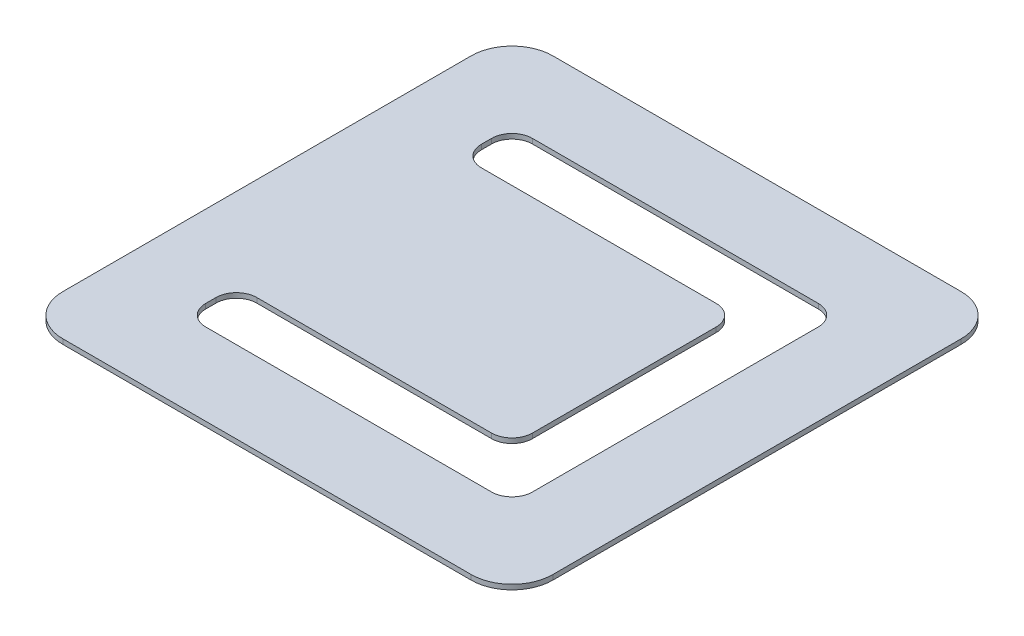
ISO-10303-21;
HEADER;
FILE_DESCRIPTION(('STEP AP214'),'2;1');
FILE_NAME('part.step','',(''),(''),'','','');
FILE_SCHEMA(('AUTOMOTIVE_DESIGN { 1 0 10303 214 1 1 1 1 }'));
ENDSEC;
DATA;
#1=APPLICATION_CONTEXT('core data for automotive mechanical design processes');
#2=APPLICATION_PROTOCOL_DEFINITION('international standard','automotive_design',2000,#1);
#3=PRODUCT_CONTEXT('',#1,'mechanical');
#4=PRODUCT('Part','Part','',(#3));
#5=PRODUCT_RELATED_PRODUCT_CATEGORY('part','',(#4));
#6=PRODUCT_DEFINITION_FORMATION('','',#4);
#7=PRODUCT_DEFINITION_CONTEXT('part definition',#1,'design');
#8=PRODUCT_DEFINITION('design','',#6,#7);
#9=PRODUCT_DEFINITION_SHAPE('','',#8);
#10=(LENGTH_UNIT() NAMED_UNIT(*) SI_UNIT(.MILLI.,.METRE.));
#11=(NAMED_UNIT(*) PLANE_ANGLE_UNIT() SI_UNIT($,.RADIAN.));
#12=(NAMED_UNIT(*) SI_UNIT($,.STERADIAN.) SOLID_ANGLE_UNIT());
#13=UNCERTAINTY_MEASURE_WITH_UNIT(LENGTH_MEASURE(1.E-05),#10,'distance_accuracy_value','');
#14=(GEOMETRIC_REPRESENTATION_CONTEXT(3) GLOBAL_UNCERTAINTY_ASSIGNED_CONTEXT((#13)) GLOBAL_UNIT_ASSIGNED_CONTEXT((#10,
#11,#12)) REPRESENTATION_CONTEXT('',''));
#15=CARTESIAN_POINT('',(0.,0.,0.));
#16=DIRECTION('',(0.,0.,1.));
#17=DIRECTION('',(1.,0.,0.));
#18=AXIS2_PLACEMENT_3D('',#15,#16,#17);
#19=CARTESIAN_POINT('',(63.5,1.524,-63.5));
#20=DIRECTION('',(0.,-1.,0.));
#21=DIRECTION('',(0.,0.,-1.));
#22=AXIS2_PLACEMENT_3D('',#19,#20,#21);
#23=PLANE('',#22);
#24=CARTESIAN_POINT('',(63.5,1.524,-63.5));
#25=DIRECTION('',(0.,1.,0.));
#26=DIRECTION('',(0.,0.,-1.));
#27=AXIS2_PLACEMENT_3D('',#24,#25,#26);
#28=CIRCLE('',#27,12.7);
#29=CARTESIAN_POINT('',(76.2,1.524,-63.5));
#30=VERTEX_POINT('',#29);
#31=CARTESIAN_POINT('',(63.5,1.524,-76.2));
#32=VERTEX_POINT('',#31);
#33=EDGE_CURVE('E317',#30,#32,#28,.T.);
#34=ORIENTED_EDGE('',*,*,#33,.T.);
#35=DIRECTION('',(-1.,0.,0.));
#36=VECTOR('',#35,1.);
#37=CARTESIAN_POINT('',(-63.5,1.524,-76.2));
#38=LINE('',#37,#36);
#39=CARTESIAN_POINT('',(-63.5,1.524,-76.2));
#40=VERTEX_POINT('',#39);
#41=EDGE_CURVE('E320',#32,#40,#38,.T.);
#42=ORIENTED_EDGE('',*,*,#41,.T.);
#43=CARTESIAN_POINT('',(-63.5,1.524,-63.5));
#44=DIRECTION('',(0.,1.,0.));
#45=DIRECTION('',(0.,0.,1.));
#46=AXIS2_PLACEMENT_3D('',#43,#44,#45);
#47=CIRCLE('',#46,12.7);
#48=CARTESIAN_POINT('',(-76.2,1.524,-63.5));
#49=VERTEX_POINT('',#48);
#50=EDGE_CURVE('E323',#40,#49,#47,.T.);
#51=ORIENTED_EDGE('',*,*,#50,.T.);
#52=DIRECTION('',(0.,0.,1.));
#53=VECTOR('',#52,1.);
#54=CARTESIAN_POINT('',(-76.2,1.524,-63.5));
#55=LINE('',#54,#53);
#56=CARTESIAN_POINT('',(-76.2,1.524,63.5));
#57=VERTEX_POINT('',#56);
#58=EDGE_CURVE('E325',#49,#57,#55,.T.);
#59=ORIENTED_EDGE('',*,*,#58,.T.);
#60=CARTESIAN_POINT('',(-63.5,1.524,63.5));
#61=DIRECTION('',(0.,1.,0.));
#62=DIRECTION('',(0.,0.,1.));
#63=AXIS2_PLACEMENT_3D('',#60,#61,#62);
#64=CIRCLE('',#63,12.7);
#65=CARTESIAN_POINT('',(-63.5,1.524,76.2));
#66=VERTEX_POINT('',#65);
#67=EDGE_CURVE('E327',#57,#66,#64,.T.);
#68=ORIENTED_EDGE('',*,*,#67,.T.);
#69=DIRECTION('',(1.,0.,0.));
#70=VECTOR('',#69,1.);
#71=CARTESIAN_POINT('',(-63.5,1.524,76.2));
#72=LINE('',#71,#70);
#73=CARTESIAN_POINT('',(63.5,1.524,76.2));
#74=VERTEX_POINT('',#73);
#75=EDGE_CURVE('E329',#66,#74,#72,.T.);
#76=ORIENTED_EDGE('',*,*,#75,.T.);
#77=CARTESIAN_POINT('',(63.5,1.524,63.5));
#78=DIRECTION('',(0.,1.,0.));
#79=DIRECTION('',(0.,0.,1.));
#80=AXIS2_PLACEMENT_3D('',#77,#78,#79);
#81=CIRCLE('',#80,12.7);
#82=CARTESIAN_POINT('',(76.2,1.524,63.5));
#83=VERTEX_POINT('',#82);
#84=EDGE_CURVE('E331',#74,#83,#81,.T.);
#85=ORIENTED_EDGE('',*,*,#84,.T.);
#86=DIRECTION('',(0.,0.,-1.));
#87=VECTOR('',#86,1.);
#88=CARTESIAN_POINT('',(76.2,1.524,-63.5));
#89=LINE('',#88,#87);
#90=EDGE_CURVE('E333',#83,#30,#89,.T.);
#91=ORIENTED_EDGE('',*,*,#90,.T.);
#92=EDGE_LOOP('',(#34,#42,#51,#59,#68,#76,#85,#91));
#93=FACE_BOUND('',#92,.T.);
#94=CARTESIAN_POINT('',(28.575,1.524,28.575));
#95=DIRECTION('',(0.,-1.,0.));
#96=DIRECTION('',(0.,0.,-1.));
#97=AXIS2_PLACEMENT_3D('',#94,#95,#96);
#98=CIRCLE('',#97,6.35);
#99=CARTESIAN_POINT('',(34.925,1.524,28.575));
#100=VERTEX_POINT('',#99);
#101=CARTESIAN_POINT('',(28.5749999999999,1.524,34.925));
#102=VERTEX_POINT('',#101);
#103=EDGE_CURVE('E196',#100,#102,#98,.T.);
#104=ORIENTED_EDGE('',*,*,#103,.F.);
#105=DIRECTION('',(0.,0.,1.));
#106=VECTOR('',#105,1.);
#107=CARTESIAN_POINT('',(34.925,1.524,-28.575));
#108=LINE('',#107,#106);
#109=CARTESIAN_POINT('',(34.925,1.524,-28.575));
#110=VERTEX_POINT('',#109);
#111=EDGE_CURVE('E245',#110,#100,#108,.T.);
#112=ORIENTED_EDGE('',*,*,#111,.F.);
#113=CARTESIAN_POINT('',(28.575,1.524,-28.5750000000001));
#114=DIRECTION('',(0.,-1.,0.));
#115=DIRECTION('',(0.,0.,-1.));
#116=AXIS2_PLACEMENT_3D('',#113,#114,#115);
#117=CIRCLE('',#116,6.35);
#118=CARTESIAN_POINT('',(28.5749999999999,1.524,-34.9250000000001));
#119=VERTEX_POINT('',#118);
#120=EDGE_CURVE('E243',#119,#110,#117,.T.);
#121=ORIENTED_EDGE('',*,*,#120,.F.);
#122=DIRECTION('',(1.,0.,0.));
#123=VECTOR('',#122,1.);
#124=CARTESIAN_POINT('',(-44.45,1.524,-34.9250000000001));
#125=LINE('',#124,#123);
#126=CARTESIAN_POINT('',(-44.45,1.524,-34.9250000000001));
#127=VERTEX_POINT('',#126);
#128=EDGE_CURVE('E241',#127,#119,#125,.T.);
#129=ORIENTED_EDGE('',*,*,#128,.F.);
#130=CARTESIAN_POINT('',(-44.45,1.524,-41.2750000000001));
#131=DIRECTION('',(0.,1.,0.));
#132=DIRECTION('',(0.,0.,-1.));
#133=AXIS2_PLACEMENT_3D('',#130,#131,#132);
#134=CIRCLE('',#133,6.35000000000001);
#135=CARTESIAN_POINT('',(-50.8,1.524,-41.2750000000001));
#136=VERTEX_POINT('',#135);
#137=EDGE_CURVE('E239',#136,#127,#134,.T.);
#138=ORIENTED_EDGE('',*,*,#137,.F.);
#139=DIRECTION('',(0.,0.,1.));
#140=VECTOR('',#139,1.);
#141=CARTESIAN_POINT('',(-50.7999999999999,1.524,-44.4499999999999));
#142=LINE('',#141,#140);
#143=CARTESIAN_POINT('',(-50.7999999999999,1.524,-44.4499999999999));
#144=VERTEX_POINT('',#143);
#145=EDGE_CURVE('E237',#144,#136,#142,.T.);
#146=ORIENTED_EDGE('',*,*,#145,.F.);
#147=CARTESIAN_POINT('',(-44.4499999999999,1.524,-44.4499999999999));
#148=DIRECTION('',(0.,1.,0.));
#149=DIRECTION('',(0.,0.,1.));
#150=AXIS2_PLACEMENT_3D('',#147,#148,#149);
#151=CIRCLE('',#150,6.35);
#152=CARTESIAN_POINT('',(-44.4499999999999,1.524,-50.7999999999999));
#153=VERTEX_POINT('',#152);
#154=EDGE_CURVE('E235',#153,#144,#151,.T.);
#155=ORIENTED_EDGE('',*,*,#154,.F.);
#156=DIRECTION('',(-1.,0.,0.));
#157=VECTOR('',#156,1.);
#158=CARTESIAN_POINT('',(-44.4499999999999,1.524,-50.7999999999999));
#159=LINE('',#158,#157);
#160=CARTESIAN_POINT('',(44.4500000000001,1.524,-50.7999999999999));
#161=VERTEX_POINT('',#160);
#162=EDGE_CURVE('E233',#161,#153,#159,.T.);
#163=ORIENTED_EDGE('',*,*,#162,.F.);
#164=CARTESIAN_POINT('',(44.4500000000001,1.524,-44.4499999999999));
#165=DIRECTION('',(0.,1.,0.));
#166=DIRECTION('',(0.,0.,-1.));
#167=AXIS2_PLACEMENT_3D('',#164,#165,#166);
#168=CIRCLE('',#167,6.35);
#169=CARTESIAN_POINT('',(50.8000000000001,1.524,-44.4499999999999));
#170=VERTEX_POINT('',#169);
#171=EDGE_CURVE('E231',#170,#161,#168,.T.);
#172=ORIENTED_EDGE('',*,*,#171,.F.);
#173=DIRECTION('',(0.,0.,-1.));
#174=VECTOR('',#173,1.);
#175=CARTESIAN_POINT('',(50.8000000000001,1.524,-44.4499999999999));
#176=LINE('',#175,#174);
#177=CARTESIAN_POINT('',(50.8000000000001,1.524,44.4500000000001));
#178=VERTEX_POINT('',#177);
#179=EDGE_CURVE('E229',#178,#170,#176,.T.);
#180=ORIENTED_EDGE('',*,*,#179,.F.);
#181=CARTESIAN_POINT('',(44.4500000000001,1.524,44.4500000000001));
#182=DIRECTION('',(0.,1.,0.));
#183=DIRECTION('',(0.,0.,-1.));
#184=AXIS2_PLACEMENT_3D('',#181,#182,#183);
#185=CIRCLE('',#184,6.35);
#186=CARTESIAN_POINT('',(44.4500000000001,1.524,50.8000000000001));
#187=VERTEX_POINT('',#186);
#188=EDGE_CURVE('E227',#187,#178,#185,.T.);
#189=ORIENTED_EDGE('',*,*,#188,.F.);
#190=DIRECTION('',(1.,0.,0.));
#191=VECTOR('',#190,1.);
#192=CARTESIAN_POINT('',(-44.4499999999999,1.524,50.8000000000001));
#193=LINE('',#192,#191);
#194=CARTESIAN_POINT('',(-44.4499999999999,1.524,50.8000000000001));
#195=VERTEX_POINT('',#194);
#196=EDGE_CURVE('E225',#195,#187,#193,.T.);
#197=ORIENTED_EDGE('',*,*,#196,.F.);
#198=CARTESIAN_POINT('',(-44.4499999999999,1.524,44.4500000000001));
#199=DIRECTION('',(0.,1.,0.));
#200=DIRECTION('',(0.,0.,1.));
#201=AXIS2_PLACEMENT_3D('',#198,#199,#200);
#202=CIRCLE('',#201,6.35);
#203=CARTESIAN_POINT('',(-50.7999999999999,1.524,44.4500000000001));
#204=VERTEX_POINT('',#203);
#205=EDGE_CURVE('E223',#204,#195,#202,.T.);
#206=ORIENTED_EDGE('',*,*,#205,.F.);
#207=DIRECTION('',(0.,0.,1.));
#208=VECTOR('',#207,1.);
#209=CARTESIAN_POINT('',(-50.8,1.524,41.275));
#210=LINE('',#209,#208);
#211=CARTESIAN_POINT('',(-50.8,1.524,41.275));
#212=VERTEX_POINT('',#211);
#213=EDGE_CURVE('E219',#212,#204,#210,.T.);
#214=ORIENTED_EDGE('',*,*,#213,.F.);
#215=CARTESIAN_POINT('',(-44.45,1.524,41.275));
#216=DIRECTION('',(0.,1.,0.));
#217=DIRECTION('',(0.,0.,-1.));
#218=AXIS2_PLACEMENT_3D('',#215,#216,#217);
#219=CIRCLE('',#218,6.35000000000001);
#220=CARTESIAN_POINT('',(-44.45,1.524,34.925));
#221=VERTEX_POINT('',#220);
#222=EDGE_CURVE('E217',#221,#212,#219,.T.);
#223=ORIENTED_EDGE('',*,*,#222,.F.);
#224=DIRECTION('',(-1.,0.,0.));
#225=VECTOR('',#224,1.);
#226=CARTESIAN_POINT('',(28.5749999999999,1.524,34.925));
#227=LINE('',#226,#225);
#228=EDGE_CURVE('E204',#102,#221,#227,.T.);
#229=ORIENTED_EDGE('',*,*,#228,.F.);
#230=EDGE_LOOP('',(#104,#112,#121,#129,#138,#146,#155,#163,#172,#180,#189,#197,#206,#214,#223,#229));
#231=FACE_BOUND('',#230,.T.);
#232=ADVANCED_FACE('F35',(#93,#231),#23,.F.);
#233=CARTESIAN_POINT('',(63.5,0.,-63.5));
#234=DIRECTION('',(0.,-1.,0.));
#235=DIRECTION('',(0.,0.,-1.));
#236=AXIS2_PLACEMENT_3D('',#233,#234,#235);
#237=PLANE('',#236);
#238=CARTESIAN_POINT('',(63.5,0.,-63.5));
#239=DIRECTION('',(0.,1.,0.));
#240=DIRECTION('',(0.,0.,-1.));
#241=AXIS2_PLACEMENT_3D('',#238,#239,#240);
#242=CIRCLE('',#241,12.7);
#243=CARTESIAN_POINT('',(76.2,0.,-63.5));
#244=VERTEX_POINT('',#243);
#245=CARTESIAN_POINT('',(63.5,0.,-76.2));
#246=VERTEX_POINT('',#245);
#247=EDGE_CURVE('E212',#244,#246,#242,.T.);
#248=ORIENTED_EDGE('',*,*,#247,.F.);
#249=DIRECTION('',(0.,0.,-1.));
#250=VECTOR('',#249,1.);
#251=CARTESIAN_POINT('',(76.2,0.,-63.5));
#252=LINE('',#251,#250);
#253=CARTESIAN_POINT('',(76.2,0.,63.5));
#254=VERTEX_POINT('',#253);
#255=EDGE_CURVE('E321',#254,#244,#252,.T.);
#256=ORIENTED_EDGE('',*,*,#255,.F.);
#257=CARTESIAN_POINT('',(63.5,0.,63.5));
#258=DIRECTION('',(0.,1.,0.));
#259=DIRECTION('',(0.,0.,1.));
#260=AXIS2_PLACEMENT_3D('',#257,#258,#259);
#261=CIRCLE('',#260,12.7);
#262=CARTESIAN_POINT('',(63.5,0.,76.2));
#263=VERTEX_POINT('',#262);
#264=EDGE_CURVE('E348',#263,#254,#261,.T.);
#265=ORIENTED_EDGE('',*,*,#264,.F.);
#266=DIRECTION('',(1.,0.,0.));
#267=VECTOR('',#266,1.);
#268=CARTESIAN_POINT('',(-63.5,0.,76.2));
#269=LINE('',#268,#267);
#270=CARTESIAN_POINT('',(-63.5,0.,76.2));
#271=VERTEX_POINT('',#270);
#272=EDGE_CURVE('E346',#271,#263,#269,.T.);
#273=ORIENTED_EDGE('',*,*,#272,.F.);
#274=CARTESIAN_POINT('',(-63.5,0.,63.5));
#275=DIRECTION('',(0.,1.,0.));
#276=DIRECTION('',(0.,0.,1.));
#277=AXIS2_PLACEMENT_3D('',#274,#275,#276);
#278=CIRCLE('',#277,12.7);
#279=CARTESIAN_POINT('',(-76.2,0.,63.5));
#280=VERTEX_POINT('',#279);
#281=EDGE_CURVE('E344',#280,#271,#278,.T.);
#282=ORIENTED_EDGE('',*,*,#281,.F.);
#283=DIRECTION('',(0.,0.,1.));
#284=VECTOR('',#283,1.);
#285=CARTESIAN_POINT('',(-76.2,0.,-63.5));
#286=LINE('',#285,#284);
#287=CARTESIAN_POINT('',(-76.2,0.,-63.5));
#288=VERTEX_POINT('',#287);
#289=EDGE_CURVE('E342',#288,#280,#286,.T.);
#290=ORIENTED_EDGE('',*,*,#289,.F.);
#291=CARTESIAN_POINT('',(-63.5,0.,-63.5));
#292=DIRECTION('',(0.,1.,0.));
#293=DIRECTION('',(0.,0.,1.));
#294=AXIS2_PLACEMENT_3D('',#291,#292,#293);
#295=CIRCLE('',#294,12.7);
#296=CARTESIAN_POINT('',(-63.5,0.,-76.2));
#297=VERTEX_POINT('',#296);
#298=EDGE_CURVE('E340',#297,#288,#295,.T.);
#299=ORIENTED_EDGE('',*,*,#298,.F.);
#300=DIRECTION('',(-1.,0.,0.));
#301=VECTOR('',#300,1.);
#302=CARTESIAN_POINT('',(-63.5,0.,-76.2));
#303=LINE('',#302,#301);
#304=EDGE_CURVE('E338',#246,#297,#303,.T.);
#305=ORIENTED_EDGE('',*,*,#304,.F.);
#306=EDGE_LOOP('',(#248,#256,#265,#273,#282,#290,#299,#305));
#307=FACE_BOUND('',#306,.T.);
#308=DIRECTION('',(0.,0.,1.));
#309=VECTOR('',#308,1.);
#310=CARTESIAN_POINT('',(34.925,0.,-28.575));
#311=LINE('',#310,#309);
#312=CARTESIAN_POINT('',(34.925,0.,-28.575));
#313=VERTEX_POINT('',#312);
#314=CARTESIAN_POINT('',(34.925,0.,28.575));
#315=VERTEX_POINT('',#314);
#316=EDGE_CURVE('E205',#313,#315,#311,.T.);
#317=ORIENTED_EDGE('',*,*,#316,.T.);
#318=CARTESIAN_POINT('',(28.575,0.,28.575));
#319=DIRECTION('',(0.,-1.,0.));
#320=DIRECTION('',(0.,0.,-1.));
#321=AXIS2_PLACEMENT_3D('',#318,#319,#320);
#322=CIRCLE('',#321,6.35);
#323=CARTESIAN_POINT('',(28.5749999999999,0.,34.925));
#324=VERTEX_POINT('',#323);
#325=EDGE_CURVE('E58',#315,#324,#322,.T.);
#326=ORIENTED_EDGE('',*,*,#325,.T.);
#327=DIRECTION('',(-1.,0.,0.));
#328=VECTOR('',#327,1.);
#329=CARTESIAN_POINT('',(28.5749999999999,0.,34.925));
#330=LINE('',#329,#328);
#331=CARTESIAN_POINT('',(-44.45,0.,34.925));
#332=VERTEX_POINT('',#331);
#333=EDGE_CURVE('E211',#324,#332,#330,.T.);
#334=ORIENTED_EDGE('',*,*,#333,.T.);
#335=CARTESIAN_POINT('',(-44.45,0.,41.275));
#336=DIRECTION('',(0.,1.,0.));
#337=DIRECTION('',(0.,0.,-1.));
#338=AXIS2_PLACEMENT_3D('',#335,#336,#337);
#339=CIRCLE('',#338,6.35000000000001);
#340=CARTESIAN_POINT('',(-50.8,0.,41.275));
#341=VERTEX_POINT('',#340);
#342=EDGE_CURVE('E249',#332,#341,#339,.T.);
#343=ORIENTED_EDGE('',*,*,#342,.T.);
#344=DIRECTION('',(0.,0.,1.));
#345=VECTOR('',#344,1.);
#346=CARTESIAN_POINT('',(-50.8,0.,41.275));
#347=LINE('',#346,#345);
#348=CARTESIAN_POINT('',(-50.7999999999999,0.,44.4500000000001));
#349=VERTEX_POINT('',#348);
#350=EDGE_CURVE('E252',#341,#349,#347,.T.);
#351=ORIENTED_EDGE('',*,*,#350,.T.);
#352=CARTESIAN_POINT('',(-44.4499999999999,0.,44.4500000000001));
#353=DIRECTION('',(0.,1.,0.));
#354=DIRECTION('',(0.,0.,1.));
#355=AXIS2_PLACEMENT_3D('',#352,#353,#354);
#356=CIRCLE('',#355,6.35);
#357=CARTESIAN_POINT('',(-44.4499999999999,0.,50.8000000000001));
#358=VERTEX_POINT('',#357);
#359=EDGE_CURVE('E255',#349,#358,#356,.T.);
#360=ORIENTED_EDGE('',*,*,#359,.T.);
#361=DIRECTION('',(1.,0.,0.));
#362=VECTOR('',#361,1.);
#363=CARTESIAN_POINT('',(-44.4499999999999,0.,50.8000000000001));
#364=LINE('',#363,#362);
#365=CARTESIAN_POINT('',(44.4500000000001,0.,50.8000000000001));
#366=VERTEX_POINT('',#365);
#367=EDGE_CURVE('E258',#358,#366,#364,.T.);
#368=ORIENTED_EDGE('',*,*,#367,.T.);
#369=CARTESIAN_POINT('',(44.4500000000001,0.,44.4500000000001));
#370=DIRECTION('',(0.,1.,0.));
#371=DIRECTION('',(0.,0.,-1.));
#372=AXIS2_PLACEMENT_3D('',#369,#370,#371);
#373=CIRCLE('',#372,6.35);
#374=CARTESIAN_POINT('',(50.8000000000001,0.,44.4500000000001));
#375=VERTEX_POINT('',#374);
#376=EDGE_CURVE('E261',#366,#375,#373,.T.);
#377=ORIENTED_EDGE('',*,*,#376,.T.);
#378=DIRECTION('',(0.,0.,-1.));
#379=VECTOR('',#378,1.);
#380=CARTESIAN_POINT('',(50.8000000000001,0.,-44.4499999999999));
#381=LINE('',#380,#379);
#382=CARTESIAN_POINT('',(50.8000000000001,0.,-44.4499999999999));
#383=VERTEX_POINT('',#382);
#384=EDGE_CURVE('E264',#375,#383,#381,.T.);
#385=ORIENTED_EDGE('',*,*,#384,.T.);
#386=CARTESIAN_POINT('',(44.4500000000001,0.,-44.4499999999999));
#387=DIRECTION('',(0.,1.,0.));
#388=DIRECTION('',(0.,0.,-1.));
#389=AXIS2_PLACEMENT_3D('',#386,#387,#388);
#390=CIRCLE('',#389,6.35);
#391=CARTESIAN_POINT('',(44.4500000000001,0.,-50.7999999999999));
#392=VERTEX_POINT('',#391);
#393=EDGE_CURVE('E267',#383,#392,#390,.T.);
#394=ORIENTED_EDGE('',*,*,#393,.T.);
#395=DIRECTION('',(-1.,0.,0.));
#396=VECTOR('',#395,1.);
#397=CARTESIAN_POINT('',(-44.4499999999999,0.,-50.7999999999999));
#398=LINE('',#397,#396);
#399=CARTESIAN_POINT('',(-44.4499999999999,0.,-50.7999999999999));
#400=VERTEX_POINT('',#399);
#401=EDGE_CURVE('E270',#392,#400,#398,.T.);
#402=ORIENTED_EDGE('',*,*,#401,.T.);
#403=CARTESIAN_POINT('',(-44.4499999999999,0.,-44.4499999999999));
#404=DIRECTION('',(0.,1.,0.));
#405=DIRECTION('',(0.,0.,1.));
#406=AXIS2_PLACEMENT_3D('',#403,#404,#405);
#407=CIRCLE('',#406,6.35);
#408=CARTESIAN_POINT('',(-50.7999999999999,0.,-44.4499999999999));
#409=VERTEX_POINT('',#408);
#410=EDGE_CURVE('E273',#400,#409,#407,.T.);
#411=ORIENTED_EDGE('',*,*,#410,.T.);
#412=DIRECTION('',(0.,0.,1.));
#413=VECTOR('',#412,1.);
#414=CARTESIAN_POINT('',(-50.7999999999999,0.,-44.4499999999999));
#415=LINE('',#414,#413);
#416=CARTESIAN_POINT('',(-50.8,0.,-41.2750000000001));
#417=VERTEX_POINT('',#416);
#418=EDGE_CURVE('E276',#409,#417,#415,.T.);
#419=ORIENTED_EDGE('',*,*,#418,.T.);
#420=CARTESIAN_POINT('',(-44.45,0.,-41.2750000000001));
#421=DIRECTION('',(0.,1.,0.));
#422=DIRECTION('',(0.,0.,-1.));
#423=AXIS2_PLACEMENT_3D('',#420,#421,#422);
#424=CIRCLE('',#423,6.35000000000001);
#425=CARTESIAN_POINT('',(-44.45,0.,-34.9250000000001));
#426=VERTEX_POINT('',#425);
#427=EDGE_CURVE('E279',#417,#426,#424,.T.);
#428=ORIENTED_EDGE('',*,*,#427,.T.);
#429=DIRECTION('',(1.,0.,0.));
#430=VECTOR('',#429,1.);
#431=CARTESIAN_POINT('',(-44.45,0.,-34.9250000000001));
#432=LINE('',#431,#430);
#433=CARTESIAN_POINT('',(28.5749999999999,0.,-34.9250000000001));
#434=VERTEX_POINT('',#433);
#435=EDGE_CURVE('E282',#426,#434,#432,.T.);
#436=ORIENTED_EDGE('',*,*,#435,.T.);
#437=CARTESIAN_POINT('',(28.575,0.,-28.5750000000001));
#438=DIRECTION('',(0.,-1.,0.));
#439=DIRECTION('',(0.,0.,-1.));
#440=AXIS2_PLACEMENT_3D('',#437,#438,#439);
#441=CIRCLE('',#440,6.35);
#442=EDGE_CURVE('E285',#434,#313,#441,.T.);
#443=ORIENTED_EDGE('',*,*,#442,.T.);
#444=EDGE_LOOP('',(#317,#326,#334,#343,#351,#360,#368,#377,#385,#394,#402,#411,#419,#428,#436,#443));
#445=FACE_BOUND('',#444,.T.);
#446=ADVANCED_FACE('F378',(#307,#445),#237,.T.);
#447=CARTESIAN_POINT('',(63.5,1.524,-63.5));
#448=DIRECTION('',(0.,-1.,0.));
#449=DIRECTION('',(0.,0.,-1.));
#450=AXIS2_PLACEMENT_3D('',#447,#448,#449);
#451=CYLINDRICAL_SURFACE('',#450,12.7);
#452=ORIENTED_EDGE('',*,*,#247,.T.);
#453=DIRECTION('',(0.,-1.,0.));
#454=VECTOR('',#453,1.);
#455=CARTESIAN_POINT('',(63.5,1.524,-76.2));
#456=LINE('',#455,#454);
#457=EDGE_CURVE('E11',#32,#246,#456,.T.);
#458=ORIENTED_EDGE('',*,*,#457,.F.);
#459=ORIENTED_EDGE('',*,*,#33,.F.);
#460=DIRECTION('',(0.,-1.,0.));
#461=VECTOR('',#460,1.);
#462=CARTESIAN_POINT('',(76.2,1.524,-63.5));
#463=LINE('',#462,#461);
#464=EDGE_CURVE('E335',#30,#244,#463,.T.);
#465=ORIENTED_EDGE('',*,*,#464,.T.);
#466=EDGE_LOOP('',(#452,#458,#459,#465));
#467=FACE_BOUND('',#466,.T.);
#468=ADVANCED_FACE('F37',(#467),#451,.T.);
#469=CARTESIAN_POINT('',(-63.5,1.524,-76.2));
#470=DIRECTION('',(0.,0.,1.));
#471=DIRECTION('',(1.,0.,0.));
#472=AXIS2_PLACEMENT_3D('',#469,#470,#471);
#473=PLANE('',#472);
#474=ORIENTED_EDGE('',*,*,#304,.T.);
#475=DIRECTION('',(0.,-1.,0.));
#476=VECTOR('',#475,1.);
#477=CARTESIAN_POINT('',(-63.5,1.524,-76.2));
#478=LINE('',#477,#476);
#479=EDGE_CURVE('E43',#40,#297,#478,.T.);
#480=ORIENTED_EDGE('',*,*,#479,.F.);
#481=ORIENTED_EDGE('',*,*,#41,.F.);
#482=ORIENTED_EDGE('',*,*,#457,.T.);
#483=EDGE_LOOP('',(#474,#480,#481,#482));
#484=FACE_BOUND('',#483,.T.);
#485=ADVANCED_FACE('F395',(#484),#473,.F.);
#486=CARTESIAN_POINT('',(-63.5,1.524,-63.5));
#487=DIRECTION('',(0.,-1.,0.));
#488=DIRECTION('',(0.,0.,-1.));
#489=AXIS2_PLACEMENT_3D('',#486,#487,#488);
#490=CYLINDRICAL_SURFACE('',#489,12.7);
#491=ORIENTED_EDGE('',*,*,#298,.T.);
#492=DIRECTION('',(0.,-1.,0.));
#493=VECTOR('',#492,1.);
#494=CARTESIAN_POINT('',(-76.2,1.524,-63.5));
#495=LINE('',#494,#493);
#496=EDGE_CURVE('E365',#49,#288,#495,.T.);
#497=ORIENTED_EDGE('',*,*,#496,.F.);
#498=ORIENTED_EDGE('',*,*,#50,.F.);
#499=ORIENTED_EDGE('',*,*,#479,.T.);
#500=EDGE_LOOP('',(#491,#497,#498,#499));
#501=FACE_BOUND('',#500,.T.);
#502=ADVANCED_FACE('F372',(#501),#490,.T.);
#503=CARTESIAN_POINT('',(-76.2,1.524,-63.5));
#504=DIRECTION('',(1.,0.,0.));
#505=DIRECTION('',(0.,0.,-1.));
#506=AXIS2_PLACEMENT_3D('',#503,#504,#505);
#507=PLANE('',#506);
#508=ORIENTED_EDGE('',*,*,#289,.T.);
#509=DIRECTION('',(0.,-1.,0.));
#510=VECTOR('',#509,1.);
#511=CARTESIAN_POINT('',(-76.2,1.524,63.5));
#512=LINE('',#511,#510);
#513=EDGE_CURVE('E362',#57,#280,#512,.T.);
#514=ORIENTED_EDGE('',*,*,#513,.F.);
#515=ORIENTED_EDGE('',*,*,#58,.F.);
#516=ORIENTED_EDGE('',*,*,#496,.T.);
#517=EDGE_LOOP('',(#508,#514,#515,#516));
#518=FACE_BOUND('',#517,.T.);
#519=ADVANCED_FACE('F384',(#518),#507,.F.);
#520=CARTESIAN_POINT('',(-63.5,1.524,63.5));
#521=DIRECTION('',(0.,-1.,0.));
#522=DIRECTION('',(0.,0.,-1.));
#523=AXIS2_PLACEMENT_3D('',#520,#521,#522);
#524=CYLINDRICAL_SURFACE('',#523,12.7);
#525=ORIENTED_EDGE('',*,*,#281,.T.);
#526=DIRECTION('',(0.,-1.,0.));
#527=VECTOR('',#526,1.);
#528=CARTESIAN_POINT('',(-63.5,1.524,76.2));
#529=LINE('',#528,#527);
#530=EDGE_CURVE('E359',#66,#271,#529,.T.);
#531=ORIENTED_EDGE('',*,*,#530,.F.);
#532=ORIENTED_EDGE('',*,*,#67,.F.);
#533=ORIENTED_EDGE('',*,*,#513,.T.);
#534=EDGE_LOOP('',(#525,#531,#532,#533));
#535=FACE_BOUND('',#534,.T.);
#536=ADVANCED_FACE('F388',(#535),#524,.T.);
#537=CARTESIAN_POINT('',(-63.5,1.524,76.2));
#538=DIRECTION('',(0.,0.,-1.));
#539=DIRECTION('',(-1.,0.,0.));
#540=AXIS2_PLACEMENT_3D('',#537,#538,#539);
#541=PLANE('',#540);
#542=ORIENTED_EDGE('',*,*,#272,.T.);
#543=DIRECTION('',(0.,-1.,0.));
#544=VECTOR('',#543,1.);
#545=CARTESIAN_POINT('',(63.5,1.524,76.2));
#546=LINE('',#545,#544);
#547=EDGE_CURVE('E356',#74,#263,#546,.T.);
#548=ORIENTED_EDGE('',*,*,#547,.F.);
#549=ORIENTED_EDGE('',*,*,#75,.F.);
#550=ORIENTED_EDGE('',*,*,#530,.T.);
#551=EDGE_LOOP('',(#542,#548,#549,#550));
#552=FACE_BOUND('',#551,.T.);
#553=ADVANCED_FACE('F408',(#552),#541,.F.);
#554=CARTESIAN_POINT('',(63.5,1.524,63.5));
#555=DIRECTION('',(0.,-1.,0.));
#556=DIRECTION('',(0.,0.,-1.));
#557=AXIS2_PLACEMENT_3D('',#554,#555,#556);
#558=CYLINDRICAL_SURFACE('',#557,12.7);
#559=ORIENTED_EDGE('',*,*,#264,.T.);
#560=DIRECTION('',(0.,-1.,0.));
#561=VECTOR('',#560,1.);
#562=CARTESIAN_POINT('',(76.2,1.524,63.5));
#563=LINE('',#562,#561);
#564=EDGE_CURVE('E353',#83,#254,#563,.T.);
#565=ORIENTED_EDGE('',*,*,#564,.F.);
#566=ORIENTED_EDGE('',*,*,#84,.F.);
#567=ORIENTED_EDGE('',*,*,#547,.T.);
#568=EDGE_LOOP('',(#559,#565,#566,#567));
#569=FACE_BOUND('',#568,.T.);
#570=ADVANCED_FACE('F406',(#569),#558,.T.);
#571=CARTESIAN_POINT('',(76.2,1.524,-63.5));
#572=DIRECTION('',(-1.,0.,0.));
#573=DIRECTION('',(0.,0.,1.));
#574=AXIS2_PLACEMENT_3D('',#571,#572,#573);
#575=PLANE('',#574);
#576=ORIENTED_EDGE('',*,*,#255,.T.);
#577=ORIENTED_EDGE('',*,*,#464,.F.);
#578=ORIENTED_EDGE('',*,*,#90,.F.);
#579=ORIENTED_EDGE('',*,*,#564,.T.);
#580=EDGE_LOOP('',(#576,#577,#578,#579));
#581=FACE_BOUND('',#580,.T.);
#582=ADVANCED_FACE('F401',(#581),#575,.F.);
#583=CARTESIAN_POINT('',(28.575,1.524,28.575));
#584=DIRECTION('',(0.,-1.,0.));
#585=DIRECTION('',(0.,0.,-1.));
#586=AXIS2_PLACEMENT_3D('',#583,#584,#585);
#587=CYLINDRICAL_SURFACE('',#586,6.35);
#588=ORIENTED_EDGE('',*,*,#325,.F.);
#589=DIRECTION('',(0.,-1.,0.));
#590=VECTOR('',#589,1.);
#591=CARTESIAN_POINT('',(34.925,1.524,28.575));
#592=LINE('',#591,#590);
#593=EDGE_CURVE('E200',#100,#315,#592,.T.);
#594=ORIENTED_EDGE('',*,*,#593,.F.);
#595=ORIENTED_EDGE('',*,*,#103,.T.);
#596=DIRECTION('',(0.,-1.,0.));
#597=VECTOR('',#596,1.);
#598=CARTESIAN_POINT('',(28.5749999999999,1.524,34.925));
#599=LINE('',#598,#597);
#600=EDGE_CURVE('E199',#102,#324,#599,.T.);
#601=ORIENTED_EDGE('',*,*,#600,.T.);
#602=EDGE_LOOP('',(#588,#594,#595,#601));
#603=FACE_BOUND('',#602,.T.);
#604=ADVANCED_FACE('F198',(#603),#587,.T.);
#605=CARTESIAN_POINT('',(28.5749999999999,1.524,34.925));
#606=DIRECTION('',(0.,0.,1.));
#607=DIRECTION('',(1.,0.,0.));
#608=AXIS2_PLACEMENT_3D('',#605,#606,#607);
#609=PLANE('',#608);
#610=ORIENTED_EDGE('',*,*,#333,.F.);
#611=ORIENTED_EDGE('',*,*,#600,.F.);
#612=ORIENTED_EDGE('',*,*,#228,.T.);
#613=DIRECTION('',(0.,-1.,0.));
#614=VECTOR('',#613,1.);
#615=CARTESIAN_POINT('',(-44.45,1.524,34.925));
#616=LINE('',#615,#614);
#617=EDGE_CURVE('E213',#221,#332,#616,.T.);
#618=ORIENTED_EDGE('',*,*,#617,.T.);
#619=EDGE_LOOP('',(#610,#611,#612,#618));
#620=FACE_BOUND('',#619,.T.);
#621=ADVANCED_FACE('F208',(#620),#609,.T.);
#622=CARTESIAN_POINT('',(-44.45,1.524,41.275));
#623=DIRECTION('',(0.,-1.,0.));
#624=DIRECTION('',(0.,0.,-1.));
#625=AXIS2_PLACEMENT_3D('',#622,#623,#624);
#626=CYLINDRICAL_SURFACE('',#625,6.35000000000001);
#627=ORIENTED_EDGE('',*,*,#342,.F.);
#628=ORIENTED_EDGE('',*,*,#617,.F.);
#629=ORIENTED_EDGE('',*,*,#222,.T.);
#630=DIRECTION('',(0.,-1.,0.));
#631=VECTOR('',#630,1.);
#632=CARTESIAN_POINT('',(-50.8,1.524,41.275));
#633=LINE('',#632,#631);
#634=EDGE_CURVE('E314',#212,#341,#633,.T.);
#635=ORIENTED_EDGE('',*,*,#634,.T.);
#636=EDGE_LOOP('',(#627,#628,#629,#635));
#637=FACE_BOUND('',#636,.T.);
#638=ADVANCED_FACE('F433',(#637),#626,.F.);
#639=CARTESIAN_POINT('',(-50.8,1.524,41.275));
#640=DIRECTION('',(1.,0.,0.));
#641=DIRECTION('',(0.,0.,-1.));
#642=AXIS2_PLACEMENT_3D('',#639,#640,#641);
#643=PLANE('',#642);
#644=ORIENTED_EDGE('',*,*,#350,.F.);
#645=ORIENTED_EDGE('',*,*,#634,.F.);
#646=ORIENTED_EDGE('',*,*,#213,.T.);
#647=DIRECTION('',(0.,-1.,0.));
#648=VECTOR('',#647,1.);
#649=CARTESIAN_POINT('',(-50.7999999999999,1.524,44.4500000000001));
#650=LINE('',#649,#648);
#651=EDGE_CURVE('E312',#204,#349,#650,.T.);
#652=ORIENTED_EDGE('',*,*,#651,.T.);
#653=EDGE_LOOP('',(#644,#645,#646,#652));
#654=FACE_BOUND('',#653,.T.);
#655=ADVANCED_FACE('F437',(#654),#643,.T.);
#656=CARTESIAN_POINT('',(-44.4499999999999,1.524,44.4500000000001));
#657=DIRECTION('',(0.,-1.,0.));
#658=DIRECTION('',(0.,0.,-1.));
#659=AXIS2_PLACEMENT_3D('',#656,#657,#658);
#660=CYLINDRICAL_SURFACE('',#659,6.35);
#661=ORIENTED_EDGE('',*,*,#359,.F.);
#662=ORIENTED_EDGE('',*,*,#651,.F.);
#663=ORIENTED_EDGE('',*,*,#205,.T.);
#664=DIRECTION('',(0.,-1.,0.));
#665=VECTOR('',#664,1.);
#666=CARTESIAN_POINT('',(-44.4499999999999,1.524,50.8000000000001));
#667=LINE('',#666,#665);
#668=EDGE_CURVE('E310',#195,#358,#667,.T.);
#669=ORIENTED_EDGE('',*,*,#668,.T.);
#670=EDGE_LOOP('',(#661,#662,#663,#669));
#671=FACE_BOUND('',#670,.T.);
#672=ADVANCED_FACE('F443',(#671),#660,.F.);
#673=CARTESIAN_POINT('',(-44.4499999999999,1.524,50.8000000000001));
#674=DIRECTION('',(0.,0.,-1.));
#675=DIRECTION('',(-1.,0.,0.));
#676=AXIS2_PLACEMENT_3D('',#673,#674,#675);
#677=PLANE('',#676);
#678=ORIENTED_EDGE('',*,*,#367,.F.);
#679=ORIENTED_EDGE('',*,*,#668,.F.);
#680=ORIENTED_EDGE('',*,*,#196,.T.);
#681=DIRECTION('',(0.,-1.,0.));
#682=VECTOR('',#681,1.);
#683=CARTESIAN_POINT('',(44.4500000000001,1.524,50.8000000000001));
#684=LINE('',#683,#682);
#685=EDGE_CURVE('E308',#187,#366,#684,.T.);
#686=ORIENTED_EDGE('',*,*,#685,.T.);
#687=EDGE_LOOP('',(#678,#679,#680,#686));
#688=FACE_BOUND('',#687,.T.);
#689=ADVANCED_FACE('F447',(#688),#677,.T.);
#690=CARTESIAN_POINT('',(44.4500000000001,1.524,44.4500000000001));
#691=DIRECTION('',(0.,-1.,0.));
#692=DIRECTION('',(0.,0.,-1.));
#693=AXIS2_PLACEMENT_3D('',#690,#691,#692);
#694=CYLINDRICAL_SURFACE('',#693,6.35);
#695=ORIENTED_EDGE('',*,*,#376,.F.);
#696=ORIENTED_EDGE('',*,*,#685,.F.);
#697=ORIENTED_EDGE('',*,*,#188,.T.);
#698=DIRECTION('',(0.,-1.,0.));
#699=VECTOR('',#698,1.);
#700=CARTESIAN_POINT('',(50.8000000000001,1.524,44.4500000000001));
#701=LINE('',#700,#699);
#702=EDGE_CURVE('E306',#178,#375,#701,.T.);
#703=ORIENTED_EDGE('',*,*,#702,.T.);
#704=EDGE_LOOP('',(#695,#696,#697,#703));
#705=FACE_BOUND('',#704,.T.);
#706=ADVANCED_FACE('F451',(#705),#694,.F.);
#707=CARTESIAN_POINT('',(50.8000000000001,1.524,-44.4499999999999));
#708=DIRECTION('',(-1.,0.,0.));
#709=DIRECTION('',(0.,0.,1.));
#710=AXIS2_PLACEMENT_3D('',#707,#708,#709);
#711=PLANE('',#710);
#712=ORIENTED_EDGE('',*,*,#384,.F.);
#713=ORIENTED_EDGE('',*,*,#702,.F.);
#714=ORIENTED_EDGE('',*,*,#179,.T.);
#715=DIRECTION('',(0.,-1.,0.));
#716=VECTOR('',#715,1.);
#717=CARTESIAN_POINT('',(50.8000000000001,1.524,-44.4499999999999));
#718=LINE('',#717,#716);
#719=EDGE_CURVE('E304',#170,#383,#718,.T.);
#720=ORIENTED_EDGE('',*,*,#719,.T.);
#721=EDGE_LOOP('',(#712,#713,#714,#720));
#722=FACE_BOUND('',#721,.T.);
#723=ADVANCED_FACE('F455',(#722),#711,.T.);
#724=CARTESIAN_POINT('',(44.4500000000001,1.524,-44.4499999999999));
#725=DIRECTION('',(0.,-1.,0.));
#726=DIRECTION('',(0.,0.,-1.));
#727=AXIS2_PLACEMENT_3D('',#724,#725,#726);
#728=CYLINDRICAL_SURFACE('',#727,6.35);
#729=ORIENTED_EDGE('',*,*,#393,.F.);
#730=ORIENTED_EDGE('',*,*,#719,.F.);
#731=ORIENTED_EDGE('',*,*,#171,.T.);
#732=DIRECTION('',(0.,-1.,0.));
#733=VECTOR('',#732,1.);
#734=CARTESIAN_POINT('',(44.4500000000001,1.524,-50.7999999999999));
#735=LINE('',#734,#733);
#736=EDGE_CURVE('E302',#161,#392,#735,.T.);
#737=ORIENTED_EDGE('',*,*,#736,.T.);
#738=EDGE_LOOP('',(#729,#730,#731,#737));
#739=FACE_BOUND('',#738,.T.);
#740=ADVANCED_FACE('F459',(#739),#728,.F.);
#741=CARTESIAN_POINT('',(-44.4499999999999,1.524,-50.7999999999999));
#742=DIRECTION('',(0.,0.,1.));
#743=DIRECTION('',(1.,0.,0.));
#744=AXIS2_PLACEMENT_3D('',#741,#742,#743);
#745=PLANE('',#744);
#746=ORIENTED_EDGE('',*,*,#401,.F.);
#747=ORIENTED_EDGE('',*,*,#736,.F.);
#748=ORIENTED_EDGE('',*,*,#162,.T.);
#749=DIRECTION('',(0.,-1.,0.));
#750=VECTOR('',#749,1.);
#751=CARTESIAN_POINT('',(-44.4499999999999,1.524,-50.7999999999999));
#752=LINE('',#751,#750);
#753=EDGE_CURVE('E300',#153,#400,#752,.T.);
#754=ORIENTED_EDGE('',*,*,#753,.T.);
#755=EDGE_LOOP('',(#746,#747,#748,#754));
#756=FACE_BOUND('',#755,.T.);
#757=ADVANCED_FACE('F463',(#756),#745,.T.);
#758=CARTESIAN_POINT('',(-44.4499999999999,1.524,-44.4499999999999));
#759=DIRECTION('',(0.,-1.,0.));
#760=DIRECTION('',(0.,0.,-1.));
#761=AXIS2_PLACEMENT_3D('',#758,#759,#760);
#762=CYLINDRICAL_SURFACE('',#761,6.35);
#763=ORIENTED_EDGE('',*,*,#410,.F.);
#764=ORIENTED_EDGE('',*,*,#753,.F.);
#765=ORIENTED_EDGE('',*,*,#154,.T.);
#766=DIRECTION('',(0.,-1.,0.));
#767=VECTOR('',#766,1.);
#768=CARTESIAN_POINT('',(-50.7999999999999,1.524,-44.4499999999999));
#769=LINE('',#768,#767);
#770=EDGE_CURVE('E298',#144,#409,#769,.T.);
#771=ORIENTED_EDGE('',*,*,#770,.T.);
#772=EDGE_LOOP('',(#763,#764,#765,#771));
#773=FACE_BOUND('',#772,.T.);
#774=ADVANCED_FACE('F467',(#773),#762,.F.);
#775=CARTESIAN_POINT('',(-50.7999999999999,1.524,-44.4499999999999));
#776=DIRECTION('',(1.,0.,0.));
#777=DIRECTION('',(0.,0.,-1.));
#778=AXIS2_PLACEMENT_3D('',#775,#776,#777);
#779=PLANE('',#778);
#780=ORIENTED_EDGE('',*,*,#418,.F.);
#781=ORIENTED_EDGE('',*,*,#770,.F.);
#782=ORIENTED_EDGE('',*,*,#145,.T.);
#783=DIRECTION('',(0.,-1.,0.));
#784=VECTOR('',#783,1.);
#785=CARTESIAN_POINT('',(-50.8,1.524,-41.2750000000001));
#786=LINE('',#785,#784);
#787=EDGE_CURVE('E296',#136,#417,#786,.T.);
#788=ORIENTED_EDGE('',*,*,#787,.T.);
#789=EDGE_LOOP('',(#780,#781,#782,#788));
#790=FACE_BOUND('',#789,.T.);
#791=ADVANCED_FACE('F471',(#790),#779,.T.);
#792=CARTESIAN_POINT('',(-44.45,1.524,-41.2750000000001));
#793=DIRECTION('',(0.,-1.,0.));
#794=DIRECTION('',(0.,0.,-1.));
#795=AXIS2_PLACEMENT_3D('',#792,#793,#794);
#796=CYLINDRICAL_SURFACE('',#795,6.35000000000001);
#797=ORIENTED_EDGE('',*,*,#427,.F.);
#798=ORIENTED_EDGE('',*,*,#787,.F.);
#799=ORIENTED_EDGE('',*,*,#137,.T.);
#800=DIRECTION('',(0.,-1.,0.));
#801=VECTOR('',#800,1.);
#802=CARTESIAN_POINT('',(-44.45,1.524,-34.9250000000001));
#803=LINE('',#802,#801);
#804=EDGE_CURVE('E294',#127,#426,#803,.T.);
#805=ORIENTED_EDGE('',*,*,#804,.T.);
#806=EDGE_LOOP('',(#797,#798,#799,#805));
#807=FACE_BOUND('',#806,.T.);
#808=ADVANCED_FACE('F475',(#807),#796,.F.);
#809=CARTESIAN_POINT('',(-44.45,1.524,-34.9250000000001));
#810=DIRECTION('',(0.,0.,-1.));
#811=DIRECTION('',(-1.,0.,0.));
#812=AXIS2_PLACEMENT_3D('',#809,#810,#811);
#813=PLANE('',#812);
#814=ORIENTED_EDGE('',*,*,#435,.F.);
#815=ORIENTED_EDGE('',*,*,#804,.F.);
#816=ORIENTED_EDGE('',*,*,#128,.T.);
#817=DIRECTION('',(0.,-1.,0.));
#818=VECTOR('',#817,1.);
#819=CARTESIAN_POINT('',(28.5749999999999,1.524,-34.9250000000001));
#820=LINE('',#819,#818);
#821=EDGE_CURVE('E292',#119,#434,#820,.T.);
#822=ORIENTED_EDGE('',*,*,#821,.T.);
#823=EDGE_LOOP('',(#814,#815,#816,#822));
#824=FACE_BOUND('',#823,.T.);
#825=ADVANCED_FACE('F479',(#824),#813,.T.);
#826=CARTESIAN_POINT('',(28.575,1.524,-28.5750000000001));
#827=DIRECTION('',(0.,-1.,0.));
#828=DIRECTION('',(0.,0.,-1.));
#829=AXIS2_PLACEMENT_3D('',#826,#827,#828);
#830=CYLINDRICAL_SURFACE('',#829,6.35);
#831=ORIENTED_EDGE('',*,*,#442,.F.);
#832=ORIENTED_EDGE('',*,*,#821,.F.);
#833=ORIENTED_EDGE('',*,*,#120,.T.);
#834=DIRECTION('',(0.,-1.,0.));
#835=VECTOR('',#834,1.);
#836=CARTESIAN_POINT('',(34.925,1.524,-28.575));
#837=LINE('',#836,#835);
#838=EDGE_CURVE('E50',#110,#313,#837,.T.);
#839=ORIENTED_EDGE('',*,*,#838,.T.);
#840=EDGE_LOOP('',(#831,#832,#833,#839));
#841=FACE_BOUND('',#840,.T.);
#842=ADVANCED_FACE('F483',(#841),#830,.T.);
#843=CARTESIAN_POINT('',(34.925,1.524,-28.575));
#844=DIRECTION('',(1.,0.,0.));
#845=DIRECTION('',(0.,0.,-1.));
#846=AXIS2_PLACEMENT_3D('',#843,#844,#845);
#847=PLANE('',#846);
#848=ORIENTED_EDGE('',*,*,#316,.F.);
#849=ORIENTED_EDGE('',*,*,#838,.F.);
#850=ORIENTED_EDGE('',*,*,#111,.T.);
#851=ORIENTED_EDGE('',*,*,#593,.T.);
#852=EDGE_LOOP('',(#848,#849,#850,#851));
#853=FACE_BOUND('',#852,.T.);
#854=ADVANCED_FACE('F487',(#853),#847,.T.);
#855=CLOSED_SHELL('',(#232,#446,#468,#485,#502,#519,#536,#553,#570,#582,#604,#621,#638,#655,
#672,#689,#706,#723,#740,#757,#774,#791,#808,#825,#842,#854));
#856=MANIFOLD_SOLID_BREP('B2',#855);
#857=ADVANCED_BREP_SHAPE_REPRESENTATION('',(#18,#856),#14);
#858=SHAPE_DEFINITION_REPRESENTATION(#9,#857);
ENDSEC;
END-ISO-10303-21;
